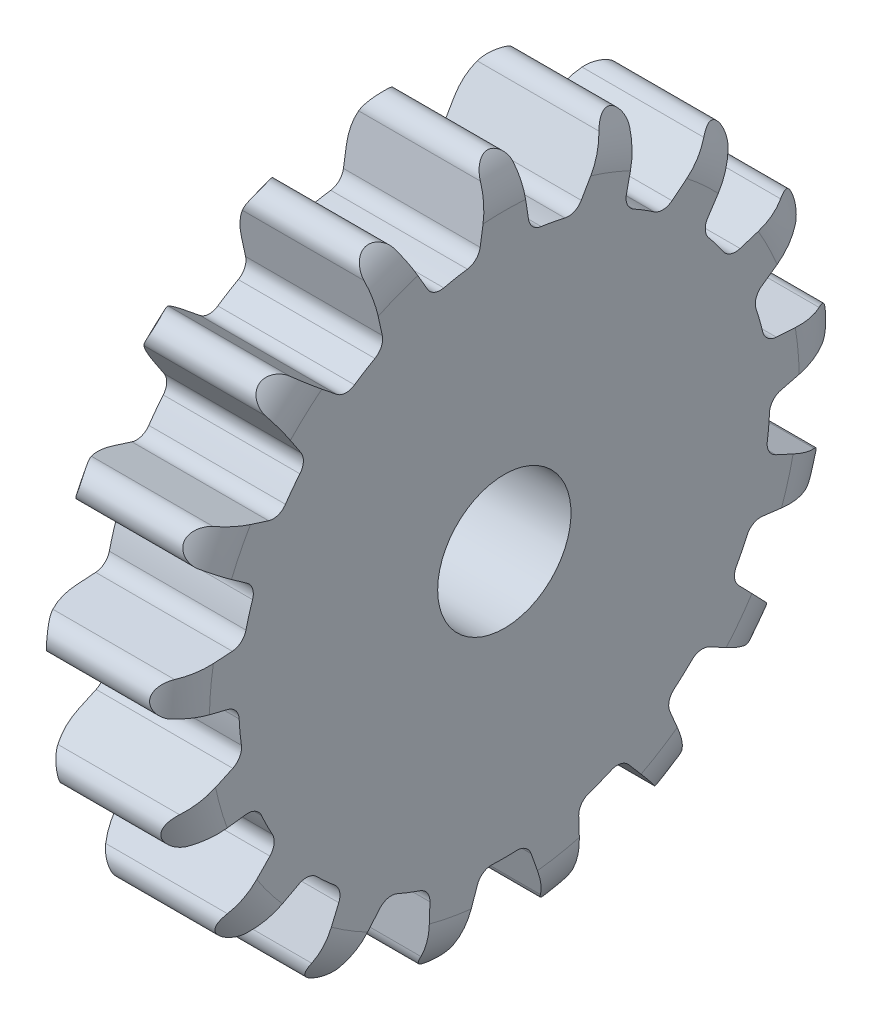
from build123d import *

# Parameters (mm, degrees)
BASPROSKE_W          = 10.414
BASPROSKE_H          = 25.8556125
TOOTHCUTROUND_DEPTH  = 39.019426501
TEETHCUTSROUND_COUNT = 17
BORSKE_R             = 5.08
BORE_DEPTH           = 50.8000508


with BuildPart() as part:
    # BasProSke → Body (revolve)
    with BuildSketch(Plane(origin=(0, 0, 0), x_dir=(1, 0, 0), z_dir=(0, 1, 0)), mode=Mode.PRIVATE) as body_sk:
        with Locations((5.207, 12.92780625)):
            Rectangle(BASPROSKE_W, BASPROSKE_H)
    revolve(body_sk.sketch.rotate(Axis((-10, 0, 0), (1, 0, 0)), 180), axis=Axis((-10, 0, 0), (1, 0, 0)))

    # SidSke (on Front Plane) → Sides (revolve, cut)
    with BuildSketch(Plane.XY, mode=Mode.PRIVATE) as sides_sk:
        with BuildLine():
            Line((12.954, 22.4774125), (12.954, 29.6656125))
            Line((12.954, 29.6656125), (-2.54, 29.6656125))
            Line((-2.54, 29.6656125), (-2.54, 22.4774125))
            Line((-2.54, 22.4774125), (0, 22.4774125))
            ThreePointArc((0, 22.4774125), (0.824527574, 25.251823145), (3.030454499, 27.1256125))
            Line((3.030454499, 27.1256125), (7.383545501, 27.1256125))
            ThreePointArc((7.383545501, 27.1256125), (9.589472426, 25.251823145), (10.414, 22.4774125))
            Line((10.414, 22.4774125), (12.954, 22.4774125))
        make_face()
    revolve(sides_sk.sketch.rotate(Axis((-14.834179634, 0, 0), (1, 0, 0)), 90), axis=Axis((-14.834179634, 0, 0), (1, 0, 0)), mode=Mode.SUBTRACT)

    # TooCutRouSke → ToothCutRound (cut, through all)
    with BuildSketch(Plane(origin=(0, 0, 0), x_dir=(0, 0, -1), z_dir=(1, 0, 0))):
        with BuildLine():
            Line((-5.862352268, 20.238374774), (-7.780026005, 23.559883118))
            ThreePointArc((-7.780026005, 23.559883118), (-8.458426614, 24.12321982), (-9.34012454, 24.10964063))
            Line((-9.34012454, 24.10964063), (-10.257678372, 26.478120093))
            ThreePointArc((-10.257678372, 26.478120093), (-5.217680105, 27.912123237), (0, 28.3956125))
            Line((0, 28.3956125), (0, 25.8556125))
            ThreePointArc((0, 25.8556125), (-0.8270642, 25.54976869), (-1.256153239, 24.779406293))
            Line((-1.256153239, 24.779406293), (-1.844463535, 20.989448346))
            ThreePointArc((-1.844463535, 20.989448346), (-2.171553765, 20.350753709), (-2.814892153, 20.032894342))
            ThreePointArc((-2.814892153, 20.032894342), (-3.71719631, 19.885243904), (-4.611907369, 19.69697398))
            ThreePointArc((-4.611907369, 19.69697398), (-5.326626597, 19.760968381), (-5.862352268, 20.238374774))
        make_face()
    toothcutround = extrude(amount=TOOTHCUTROUND_DEPTH, mode=Mode.SUBTRACT)

    # TeethCutsRound: ToothCutRound ×17 about axis
    teethcutsround_axis = Axis((0, 0, 0), (1, 0, 0))
    for i in range(1, TEETHCUTSROUND_COUNT):
        add(toothcutround.rotate(teethcutsround_axis, i * 360 / TEETHCUTSROUND_COUNT), mode=Mode.SUBTRACT)

    # BorSke → Bore (cut, symmetric)
    with BuildSketch(Plane(origin=(0, 0, 0), x_dir=(0, 0, -1), z_dir=(1, 0, 0))):
        with Locations(Location((0, 0, 0), (0, 0, 180))):
            Circle(BORSKE_R)
    extrude(amount=BORE_DEPTH, both=True, mode=Mode.SUBTRACT)


solid = part.part
